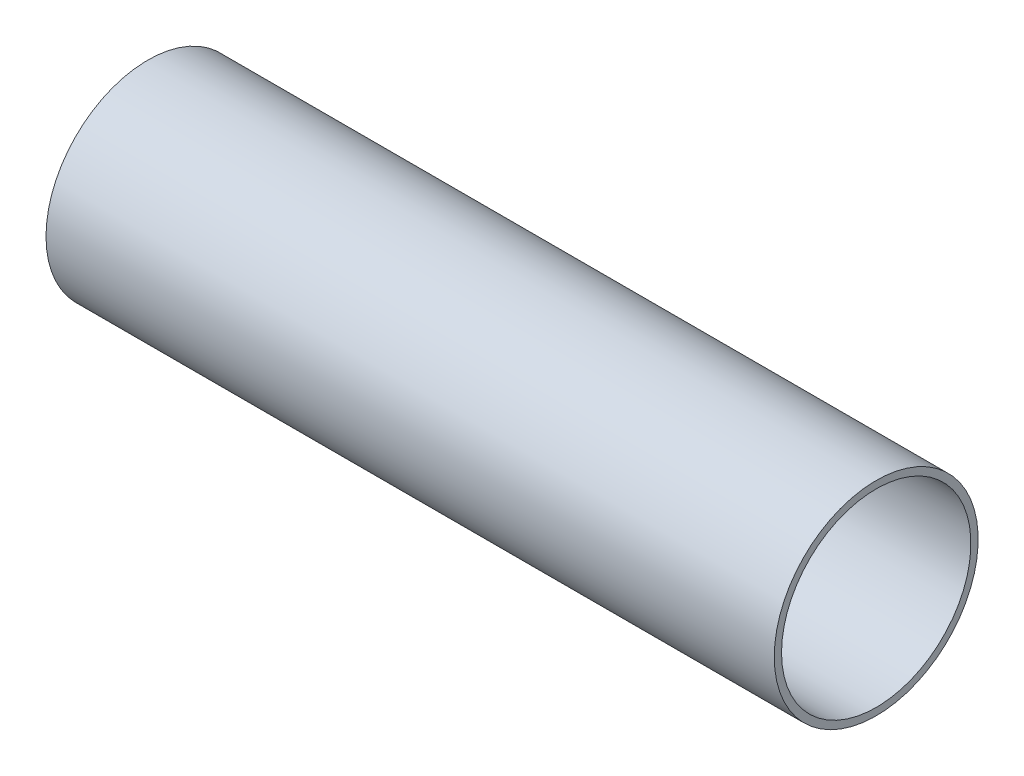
ISO-10303-21;
HEADER;
FILE_DESCRIPTION(('STEP AP214'),'2;1');
FILE_NAME('part.step','',(''),(''),'','','');
FILE_SCHEMA(('AUTOMOTIVE_DESIGN { 1 0 10303 214 1 1 1 1 }'));
ENDSEC;
DATA;
#1=APPLICATION_CONTEXT('core data for automotive mechanical design processes');
#2=APPLICATION_PROTOCOL_DEFINITION('international standard','automotive_design',2000,#1);
#3=PRODUCT_CONTEXT('',#1,'mechanical');
#4=PRODUCT('Part','Part','',(#3));
#5=PRODUCT_RELATED_PRODUCT_CATEGORY('part','',(#4));
#6=PRODUCT_DEFINITION_FORMATION('','',#4);
#7=PRODUCT_DEFINITION_CONTEXT('part definition',#1,'design');
#8=PRODUCT_DEFINITION('design','',#6,#7);
#9=PRODUCT_DEFINITION_SHAPE('','',#8);
#10=(LENGTH_UNIT() NAMED_UNIT(*) SI_UNIT(.MILLI.,.METRE.));
#11=(NAMED_UNIT(*) PLANE_ANGLE_UNIT() SI_UNIT($,.RADIAN.));
#12=(NAMED_UNIT(*) SI_UNIT($,.STERADIAN.) SOLID_ANGLE_UNIT());
#13=UNCERTAINTY_MEASURE_WITH_UNIT(LENGTH_MEASURE(1.E-05),#10,'distance_accuracy_value','');
#14=(GEOMETRIC_REPRESENTATION_CONTEXT(3) GLOBAL_UNCERTAINTY_ASSIGNED_CONTEXT((#13)) GLOBAL_UNIT_ASSIGNED_CONTEXT((#10,
#11,#12)) REPRESENTATION_CONTEXT('',''));
#15=CARTESIAN_POINT('',(0.,0.,0.));
#16=DIRECTION('',(0.,0.,1.));
#17=DIRECTION('',(1.,0.,0.));
#18=AXIS2_PLACEMENT_3D('',#15,#16,#17);
#19=CARTESIAN_POINT('',(0.,14.,0.));
#20=DIRECTION('',(1.,0.,0.));
#21=DIRECTION('',(0.,0.,-1.));
#22=AXIS2_PLACEMENT_3D('',#19,#20,#21);
#23=PLANE('',#22);
#24=CARTESIAN_POINT('',(0.,0.,0.));
#25=DIRECTION('',(-1.,0.,0.));
#26=DIRECTION('',(0.,0.,1.));
#27=AXIS2_PLACEMENT_3D('',#24,#25,#26);
#28=CIRCLE('',#27,13.);
#29=CARTESIAN_POINT('',(0.,0.,13.));
#30=VERTEX_POINT('',#29);
#31=EDGE_CURVE('E48',#30,#30,#28,.T.);
#32=ORIENTED_EDGE('',*,*,#31,.F.);
#33=EDGE_LOOP('',(#32));
#34=FACE_BOUND('',#33,.T.);
#35=CARTESIAN_POINT('',(0.,0.,0.));
#36=DIRECTION('',(-1.,0.,0.));
#37=DIRECTION('',(0.,0.,1.));
#38=AXIS2_PLACEMENT_3D('',#35,#36,#37);
#39=CIRCLE('',#38,14.);
#40=CARTESIAN_POINT('',(0.,0.,14.));
#41=VERTEX_POINT('',#40);
#42=EDGE_CURVE('E11',#41,#41,#39,.T.);
#43=ORIENTED_EDGE('',*,*,#42,.T.);
#44=EDGE_LOOP('',(#43));
#45=FACE_BOUND('',#44,.T.);
#46=ADVANCED_FACE('F33',(#34,#45),#23,.F.);
#47=CARTESIAN_POINT('',(0.,0.,0.));
#48=DIRECTION('',(-1.,0.,0.));
#49=DIRECTION('',(0.,0.,1.));
#50=AXIS2_PLACEMENT_3D('',#47,#48,#49);
#51=CYLINDRICAL_SURFACE('',#50,14.);
#52=CARTESIAN_POINT('',(100.,0.,0.));
#53=DIRECTION('',(-1.,0.,0.));
#54=DIRECTION('',(0.,0.,1.));
#55=AXIS2_PLACEMENT_3D('',#52,#53,#54);
#56=CIRCLE('',#55,14.);
#57=CARTESIAN_POINT('',(100.,0.,14.));
#58=VERTEX_POINT('',#57);
#59=EDGE_CURVE('E40',#58,#58,#56,.T.);
#60=ORIENTED_EDGE('',*,*,#59,.T.);
#61=EDGE_LOOP('',(#60));
#62=FACE_BOUND('',#61,.T.);
#63=ORIENTED_EDGE('',*,*,#42,.F.);
#64=EDGE_LOOP('',(#63));
#65=FACE_BOUND('',#64,.T.);
#66=ADVANCED_FACE('F58',(#62,#65),#51,.T.);
#67=CARTESIAN_POINT('',(100.,13.,0.));
#68=DIRECTION('',(-1.,0.,0.));
#69=DIRECTION('',(0.,0.,1.));
#70=AXIS2_PLACEMENT_3D('',#67,#68,#69);
#71=PLANE('',#70);
#72=ORIENTED_EDGE('',*,*,#59,.F.);
#73=EDGE_LOOP('',(#72));
#74=FACE_BOUND('',#73,.T.);
#75=CARTESIAN_POINT('',(100.,0.,0.));
#76=DIRECTION('',(-1.,0.,0.));
#77=DIRECTION('',(0.,0.,1.));
#78=AXIS2_PLACEMENT_3D('',#75,#76,#77);
#79=CIRCLE('',#78,13.);
#80=CARTESIAN_POINT('',(100.,0.,13.));
#81=VERTEX_POINT('',#80);
#82=EDGE_CURVE('E44',#81,#81,#79,.T.);
#83=ORIENTED_EDGE('',*,*,#82,.T.);
#84=EDGE_LOOP('',(#83));
#85=FACE_BOUND('',#84,.T.);
#86=ADVANCED_FACE('F62',(#74,#85),#71,.F.);
#87=CARTESIAN_POINT('',(0.,0.,0.));
#88=DIRECTION('',(-1.,0.,0.));
#89=DIRECTION('',(0.,0.,1.));
#90=AXIS2_PLACEMENT_3D('',#87,#88,#89);
#91=CYLINDRICAL_SURFACE('',#90,13.);
#92=ORIENTED_EDGE('',*,*,#31,.T.);
#93=EDGE_LOOP('',(#92));
#94=FACE_BOUND('',#93,.T.);
#95=ORIENTED_EDGE('',*,*,#82,.F.);
#96=EDGE_LOOP('',(#95));
#97=FACE_BOUND('',#96,.T.);
#98=ADVANCED_FACE('F54',(#94,#97),#91,.F.);
#99=CLOSED_SHELL('',(#46,#66,#86,#98));
#100=MANIFOLD_SOLID_BREP('B2',#99);
#101=ADVANCED_BREP_SHAPE_REPRESENTATION('',(#18,#100),#14);
#102=SHAPE_DEFINITION_REPRESENTATION(#9,#101);
ENDSEC;
END-ISO-10303-21;
